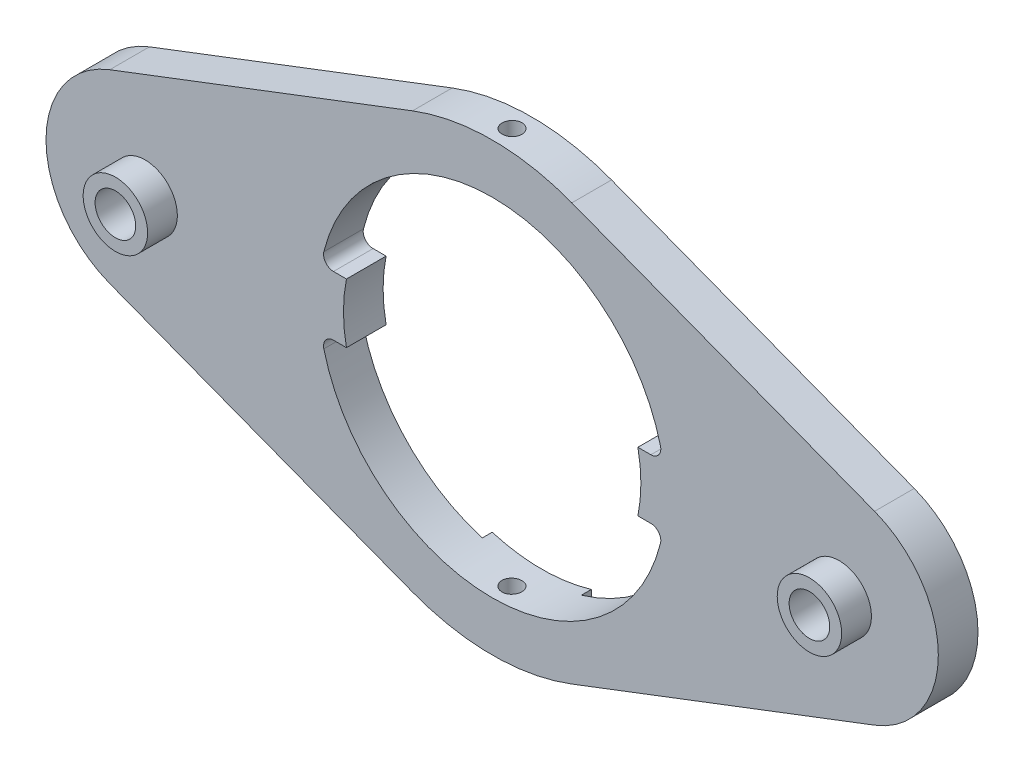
from build123d import *

# Parameters (mm, degrees)
SKETCH_1_R          = 17.5
EXTRUDE_1_DEPTH     = 2
HOLE_WIZARD_M4_1_D  = 3.3
EXTRUDE_2_DEPTH     = 4
FILLET_1_R          = 1
SKETCH_6_R          = 1
CUT_EXTRUDE_1_DEPTH = 52
SKETCH_7_R          = 3.25
SKETCH_7_R_2        = 2.05
EXTRUDE_3_DEPTH     = 3
EXTRUDE_START       = 1
EXTRUDE_4_DEPTH     = 1


with BuildPart() as part:
    # Sketch 1 → Extrude 1 (new, symmetric)
    with BuildSketch(Plane.XY):
        with BuildLine():
            Line((-8.035714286, 21.016119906), (-38.571428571, 9.340497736))
            ThreePointArc((-38.571428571, 9.340497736), (-45, 0), (-38.571428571, -9.340497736))
            Line((-38.571428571, -9.340497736), (-8.035714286, -21.016119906))
            ThreePointArc((-8.035714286, -21.016119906), (0, -22.5), (8.035714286, -21.016119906))
            Line((8.035714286, -21.016119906), (38.571428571, -9.340497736))
            ThreePointArc((38.571428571, -9.340497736), (45, 0), (38.571428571, 9.340497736))
            Line((38.571428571, 9.340497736), (8.035714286, 21.016119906))
            ThreePointArc((8.035714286, 21.016119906), (0, 22.5), (-8.035714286, 21.016119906))
        make_face()
        Circle(SKETCH_1_R, mode=Mode.SUBTRACT)
    extrude(amount=EXTRUDE_1_DEPTH, both=True)

    # Hole Wizard M4 _1 (through all)
    with Locations(Plane(origin=(-35, 0, 2), x_dir=(1, 0, 0), z_dir=(0, 0, 1))):
        with Locations((0, 0), (70, 0)):
            Hole(HOLE_WIZARD_M4_1_D / 2)

    # Sketch 5 → Extrude 2 (add)
    with BuildSketch(Plane.XY.offset(2)):
        with BuildLine():
            Line((14.696938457, 3), (18, 3))
            Line((18, 3), (18, -3))
            Line((18, -3), (14.696938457, -3))
            ThreePointArc((14.696938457, -3), (15, 0), (14.696938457, 3))
        make_face()
        with BuildLine():
            Line((-18, 3), (-14.696938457, 3))
            ThreePointArc((-14.696938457, 3), (-15, 0), (-14.696938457, -3))
            Line((-14.696938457, -3), (-18, -3))
            Line((-18, -3), (-18, 3))
        make_face()
    extrude(amount=-EXTRUDE_2_DEPTH)

    # Fillet 1
    fillet_1_edges = [part.edges().sort_by_distance(p)[0] for p in [
        (17.24093965, 3, 0),
        (17.24093965, -3, 0),
        (-17.24093965, -3, 0),
        (-17.24093965, 3, 0),
    ]]
    fillet(fillet_1_edges, radius=FILLET_1_R)

    # Sketch 6 → Cut-Extrude 1 (cut)
    with BuildSketch(Plane(origin=(0, 22.5, 0), x_dir=(1, 0, 0), z_dir=(0, 1, 0))):
        with Locations(Location((0, 0, 0), (0, 0, 270))):
            Circle(SKETCH_6_R)
    extrude(amount=-CUT_EXTRUDE_1_DEPTH, mode=Mode.SUBTRACT)

    # Sketch 7 → Extrude 3 (add)
    # profile 1 of 2: a face of its own
    with BuildSketch(Plane.XY.offset(2)):
        with Locations((-35, 0)):
            Circle(SKETCH_7_R)
        with Locations((-35, 0)):
            Circle(SKETCH_7_R_2, mode=Mode.SUBTRACT)
    # profile 2 of 2: a face of its own
    with BuildSketch(Plane.XY.offset(2)):
        with Locations(Location((35, 0, 0), (0, 0, 180))):
            Circle(SKETCH_7_R)
        with Locations(Location((35, 0, 0), (0, 0, 180))):
            Circle(SKETCH_7_R_2, mode=Mode.SUBTRACT)
    extrude(amount=EXTRUDE_3_DEPTH)

    # Sketch 8 → Extrude 4 (add)
    with BuildSketch(Plane(origin=(0, 0, -2), x_dir=(-1, 0, 0), z_dir=(0, 0, -1)).offset(EXTRUDE_START)):
        with BuildLine():
            Line((-5, 18.848076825), (-5, 16.770509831))
            ThreePointArc((-5, 16.770509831), (0, 17.5), (5, 16.770509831))
            Line((5, 16.770509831), (5, 18.848076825))
            ThreePointArc((5, 18.848076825), (0, 19.5), (-5, 18.848076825))
        make_face()
        with BuildLine():
            Line((5, -16.770509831), (5, -18.848076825))
            ThreePointArc((5, -18.848076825), (0, -19.5), (-5, -18.848076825))
            Line((-5, -18.848076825), (-5, -16.770509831))
            ThreePointArc((-5, -16.770509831), (0, -17.5), (5, -16.770509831))
        make_face()
    extrude(amount=-EXTRUDE_4_DEPTH)


solid = part.part
